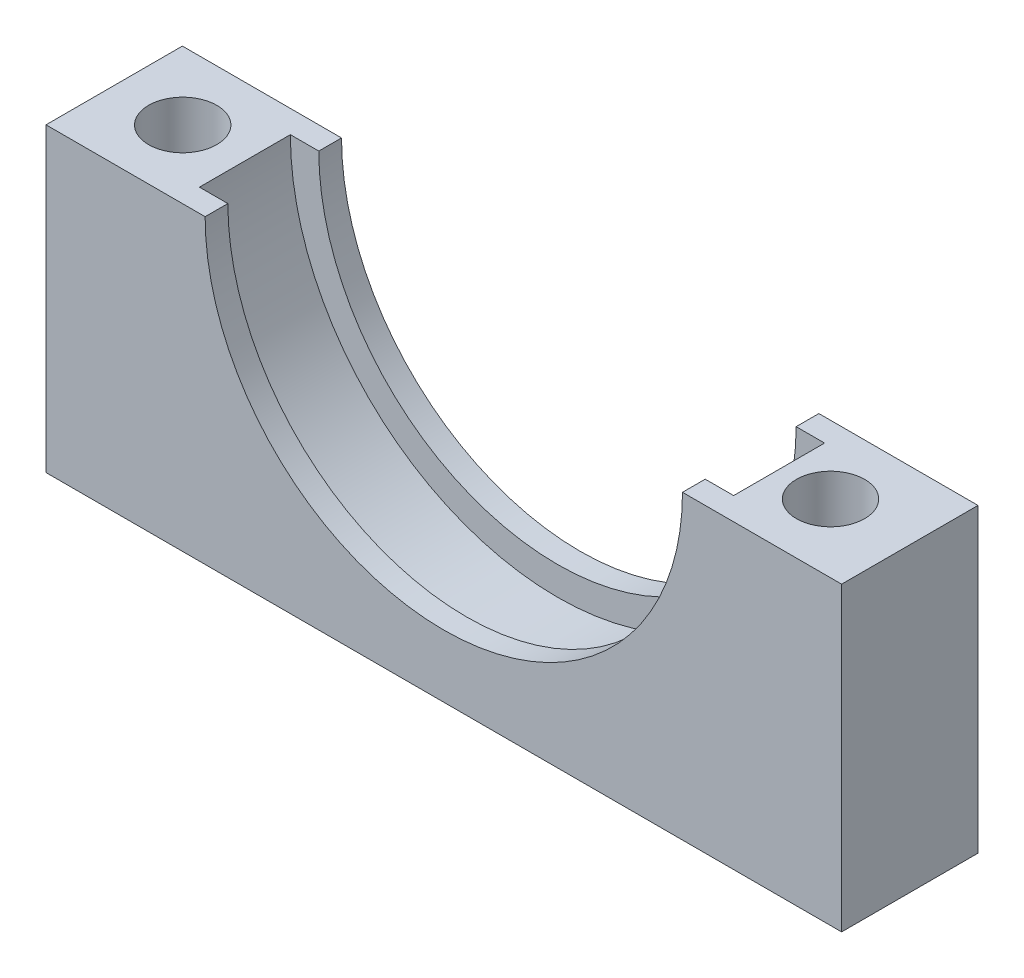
ISO-10303-21;
HEADER;
FILE_DESCRIPTION(('STEP AP214'),'2;1');
FILE_NAME('part.step','',(''),(''),'','','');
FILE_SCHEMA(('AUTOMOTIVE_DESIGN { 1 0 10303 214 1 1 1 1 }'));
ENDSEC;
DATA;
#1=APPLICATION_CONTEXT('core data for automotive mechanical design processes');
#2=APPLICATION_PROTOCOL_DEFINITION('international standard','automotive_design',2000,#1);
#3=PRODUCT_CONTEXT('',#1,'mechanical');
#4=PRODUCT('Part','Part','',(#3));
#5=PRODUCT_RELATED_PRODUCT_CATEGORY('part','',(#4));
#6=PRODUCT_DEFINITION_FORMATION('','',#4);
#7=PRODUCT_DEFINITION_CONTEXT('part definition',#1,'design');
#8=PRODUCT_DEFINITION('design','',#6,#7);
#9=PRODUCT_DEFINITION_SHAPE('','',#8);
#10=(LENGTH_UNIT() NAMED_UNIT(*) SI_UNIT(.MILLI.,.METRE.));
#11=(NAMED_UNIT(*) PLANE_ANGLE_UNIT() SI_UNIT($,.RADIAN.));
#12=(NAMED_UNIT(*) SI_UNIT($,.STERADIAN.) SOLID_ANGLE_UNIT());
#13=UNCERTAINTY_MEASURE_WITH_UNIT(LENGTH_MEASURE(1.E-05),#10,'distance_accuracy_value','');
#14=(GEOMETRIC_REPRESENTATION_CONTEXT(3) GLOBAL_UNCERTAINTY_ASSIGNED_CONTEXT((#13)) GLOBAL_UNIT_ASSIGNED_CONTEXT((#10,
#11,#12)) REPRESENTATION_CONTEXT('',''));
#15=CARTESIAN_POINT('',(0.,0.,0.));
#16=DIRECTION('',(0.,0.,1.));
#17=DIRECTION('',(1.,0.,0.));
#18=AXIS2_PLACEMENT_3D('',#15,#16,#17);
#19=CARTESIAN_POINT('',(53.,-25.,-86.8481796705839));
#20=DIRECTION('',(0.,1.,0.));
#21=DIRECTION('',(0.,0.,1.));
#22=AXIS2_PLACEMENT_3D('',#19,#20,#21);
#23=PLANE('',#22);
#24=CARTESIAN_POINT('',(45.0263356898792,-25.,-6.));
#25=DIRECTION('',(0.,1.,0.));
#26=DIRECTION('',(0.,0.,1.));
#27=AXIS2_PLACEMENT_3D('',#24,#25,#26);
#28=CIRCLE('',#27,3.);
#29=CARTESIAN_POINT('',(45.0263356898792,-25.,-3.));
#30=VERTEX_POINT('',#29);
#31=EDGE_CURVE('E206',#30,#30,#28,.T.);
#32=ORIENTED_EDGE('',*,*,#31,.F.);
#33=EDGE_LOOP('',(#32));
#34=FACE_BOUND('',#33,.T.);
#35=DIRECTION('',(0.,0.,-1.));
#36=VECTOR('',#35,1.);
#37=CARTESIAN_POINT('',(50.5,-25.,-2.));
#38=LINE('',#37,#36);
#39=CARTESIAN_POINT('',(50.5,-25.,-2.));
#40=VERTEX_POINT('',#39);
#41=CARTESIAN_POINT('',(50.5,-25.,-10.));
#42=VERTEX_POINT('',#41);
#43=EDGE_CURVE('E167',#40,#42,#38,.T.);
#44=ORIENTED_EDGE('',*,*,#43,.T.);
#45=DIRECTION('',(1.,0.,0.));
#46=VECTOR('',#45,1.);
#47=CARTESIAN_POINT('',(50.5,-25.,-10.));
#48=LINE('',#47,#46);
#49=CARTESIAN_POINT('',(53.,-25.,-10.));
#50=VERTEX_POINT('',#49);
#51=EDGE_CURVE('E189',#42,#50,#48,.T.);
#52=ORIENTED_EDGE('',*,*,#51,.T.);
#53=DIRECTION('',(0.,0.,1.));
#54=VECTOR('',#53,1.);
#55=CARTESIAN_POINT('',(53.,-25.,-86.8481796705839));
#56=LINE('',#55,#54);
#57=CARTESIAN_POINT('',(53.,-25.,-12.));
#58=VERTEX_POINT('',#57);
#59=EDGE_CURVE('E150',#58,#50,#56,.T.);
#60=ORIENTED_EDGE('',*,*,#59,.F.);
#61=DIRECTION('',(-1.,0.,0.));
#62=VECTOR('',#61,1.);
#63=CARTESIAN_POINT('',(53.,-25.,-12.));
#64=LINE('',#63,#62);
#65=CARTESIAN_POINT('',(39.,-25.,-12.));
#66=VERTEX_POINT('',#65);
#67=EDGE_CURVE('E80',#58,#66,#64,.T.);
#68=ORIENTED_EDGE('',*,*,#67,.T.);
#69=DIRECTION('',(0.,0.,1.));
#70=VECTOR('',#69,1.);
#71=CARTESIAN_POINT('',(39.,-25.,-86.8481796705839));
#72=LINE('',#71,#70);
#73=CARTESIAN_POINT('',(39.,-25.,0.));
#74=VERTEX_POINT('',#73);
#75=EDGE_CURVE('E130',#66,#74,#72,.T.);
#76=ORIENTED_EDGE('',*,*,#75,.T.);
#77=DIRECTION('',(-1.,0.,0.));
#78=VECTOR('',#77,1.);
#79=CARTESIAN_POINT('',(53.,-25.,0.));
#80=LINE('',#79,#78);
#81=CARTESIAN_POINT('',(53.,-25.,0.));
#82=VERTEX_POINT('',#81);
#83=EDGE_CURVE('E121',#82,#74,#80,.T.);
#84=ORIENTED_EDGE('',*,*,#83,.F.);
#85=CARTESIAN_POINT('',(53.,-25.,-2.));
#86=VERTEX_POINT('',#85);
#87=EDGE_CURVE('E53',#86,#82,#56,.T.);
#88=ORIENTED_EDGE('',*,*,#87,.F.);
#89=DIRECTION('',(1.,0.,0.));
#90=VECTOR('',#89,1.);
#91=CARTESIAN_POINT('',(50.5,-25.,-2.));
#92=LINE('',#91,#90);
#93=EDGE_CURVE('E45',#40,#86,#92,.T.);
#94=ORIENTED_EDGE('',*,*,#93,.F.);
#95=EDGE_LOOP('',(#44,#52,#60,#68,#76,#84,#88,#94));
#96=FACE_BOUND('',#95,.T.);
#97=ADVANCED_FACE('F30',(#34,#96),#23,.T.);
#98=CARTESIAN_POINT('',(109.,-25.,-86.8481796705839));
#99=DIRECTION('',(0.,1.,0.));
#100=DIRECTION('',(0.,0.,1.));
#101=AXIS2_PLACEMENT_3D('',#98,#99,#100);
#102=PLANE('',#101);
#103=CARTESIAN_POINT('',(102.026335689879,-25.,-6.));
#104=DIRECTION('',(0.,1.,0.));
#105=DIRECTION('',(0.,0.,1.));
#106=AXIS2_PLACEMENT_3D('',#103,#104,#105);
#107=CIRCLE('',#106,3.);
#108=CARTESIAN_POINT('',(102.026335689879,-25.,-3.));
#109=VERTEX_POINT('',#108);
#110=EDGE_CURVE('E213',#109,#109,#107,.T.);
#111=ORIENTED_EDGE('',*,*,#110,.F.);
#112=EDGE_LOOP('',(#111));
#113=FACE_BOUND('',#112,.T.);
#114=DIRECTION('',(0.,0.,1.));
#115=VECTOR('',#114,1.);
#116=CARTESIAN_POINT('',(95.,-25.,-86.8481796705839));
#117=LINE('',#116,#115);
#118=CARTESIAN_POINT('',(95.,-25.,-12.));
#119=VERTEX_POINT('',#118);
#120=CARTESIAN_POINT('',(95.,-25.,-10.));
#121=VERTEX_POINT('',#120);
#122=EDGE_CURVE('E134',#119,#121,#117,.T.);
#123=ORIENTED_EDGE('',*,*,#122,.T.);
#124=CARTESIAN_POINT('',(97.5,-25.,-10.));
#125=VERTEX_POINT('',#124);
#126=EDGE_CURVE('E175',#121,#125,#48,.T.);
#127=ORIENTED_EDGE('',*,*,#126,.T.);
#128=DIRECTION('',(0.,0.,-1.));
#129=VECTOR('',#128,1.);
#130=CARTESIAN_POINT('',(97.5,-25.,-2.));
#131=LINE('',#130,#129);
#132=CARTESIAN_POINT('',(97.5,-25.,-2.));
#133=VERTEX_POINT('',#132);
#134=EDGE_CURVE('E166',#133,#125,#131,.T.);
#135=ORIENTED_EDGE('',*,*,#134,.F.);
#136=CARTESIAN_POINT('',(95.,-25.,-2.));
#137=VERTEX_POINT('',#136);
#138=EDGE_CURVE('E156',#137,#133,#92,.T.);
#139=ORIENTED_EDGE('',*,*,#138,.F.);
#140=CARTESIAN_POINT('',(95.,-25.,0.));
#141=VERTEX_POINT('',#140);
#142=EDGE_CURVE('E138',#137,#141,#117,.T.);
#143=ORIENTED_EDGE('',*,*,#142,.T.);
#144=DIRECTION('',(-1.,0.,0.));
#145=VECTOR('',#144,1.);
#146=CARTESIAN_POINT('',(109.,-25.,0.));
#147=LINE('',#146,#145);
#148=CARTESIAN_POINT('',(109.,-25.,0.));
#149=VERTEX_POINT('',#148);
#150=EDGE_CURVE('E131',#149,#141,#147,.T.);
#151=ORIENTED_EDGE('',*,*,#150,.F.);
#152=DIRECTION('',(0.,0.,1.));
#153=VECTOR('',#152,1.);
#154=CARTESIAN_POINT('',(109.,-25.,-86.8481796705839));
#155=LINE('',#154,#153);
#156=CARTESIAN_POINT('',(109.,-25.,-12.));
#157=VERTEX_POINT('',#156);
#158=EDGE_CURVE('E139',#157,#149,#155,.T.);
#159=ORIENTED_EDGE('',*,*,#158,.F.);
#160=DIRECTION('',(-1.,0.,0.));
#161=VECTOR('',#160,1.);
#162=CARTESIAN_POINT('',(109.,-25.,-12.));
#163=LINE('',#162,#161);
#164=EDGE_CURVE('E135',#157,#119,#163,.T.);
#165=ORIENTED_EDGE('',*,*,#164,.T.);
#166=EDGE_LOOP('',(#123,#127,#135,#139,#143,#151,#159,#165));
#167=FACE_BOUND('',#166,.T.);
#168=ADVANCED_FACE('F162',(#113,#167),#102,.T.);
#169=CARTESIAN_POINT('',(74.,-25.,-86.8481796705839));
#170=DIRECTION('',(0.,0.,1.));
#171=DIRECTION('',(1.,0.,0.));
#172=AXIS2_PLACEMENT_3D('',#169,#170,#171);
#173=CYLINDRICAL_SURFACE('',#172,21.);
#174=ORIENTED_EDGE('',*,*,#59,.T.);
#175=CARTESIAN_POINT('',(74.,-25.,-9.99999999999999));
#176=DIRECTION('',(0.,0.,1.));
#177=DIRECTION('',(1.,0.,0.));
#178=AXIS2_PLACEMENT_3D('',#175,#176,#177);
#179=CIRCLE('',#178,21.);
#180=EDGE_CURVE('E12',#50,#121,#179,.T.);
#181=ORIENTED_EDGE('',*,*,#180,.T.);
#182=ORIENTED_EDGE('',*,*,#122,.F.);
#183=CARTESIAN_POINT('',(74.,-25.,-12.));
#184=DIRECTION('',(0.,0.,-1.));
#185=DIRECTION('',(-1.,0.,0.));
#186=AXIS2_PLACEMENT_3D('',#183,#184,#185);
#187=CIRCLE('',#186,21.);
#188=EDGE_CURVE('E132',#119,#58,#187,.T.);
#189=ORIENTED_EDGE('',*,*,#188,.T.);
#190=EDGE_LOOP('',(#174,#181,#182,#189));
#191=FACE_BOUND('',#190,.T.);
#192=ADVANCED_FACE('F249',(#191),#173,.F.);
#193=CARTESIAN_POINT('',(144.,19.,-12.));
#194=DIRECTION('',(0.,0.,-1.));
#195=DIRECTION('',(-1.,0.,0.));
#196=AXIS2_PLACEMENT_3D('',#193,#194,#195);
#197=PLANE('',#196);
#198=ORIENTED_EDGE('',*,*,#188,.F.);
#199=ORIENTED_EDGE('',*,*,#164,.F.);
#200=DIRECTION('',(0.,1.,0.));
#201=VECTOR('',#200,1.);
#202=CARTESIAN_POINT('',(109.,-51.5,-12.));
#203=LINE('',#202,#201);
#204=CARTESIAN_POINT('',(109.,-51.5,-12.));
#205=VERTEX_POINT('',#204);
#206=EDGE_CURVE('E140',#205,#157,#203,.T.);
#207=ORIENTED_EDGE('',*,*,#206,.F.);
#208=DIRECTION('',(1.,0.,0.));
#209=VECTOR('',#208,1.);
#210=CARTESIAN_POINT('',(39.,-51.5,-12.));
#211=LINE('',#210,#209);
#212=CARTESIAN_POINT('',(39.,-51.5,-12.));
#213=VERTEX_POINT('',#212);
#214=EDGE_CURVE('E107',#213,#205,#211,.T.);
#215=ORIENTED_EDGE('',*,*,#214,.F.);
#216=DIRECTION('',(0.,-1.,0.));
#217=VECTOR('',#216,1.);
#218=CARTESIAN_POINT('',(39.,-25.,-12.));
#219=LINE('',#218,#217);
#220=EDGE_CURVE('E86',#66,#213,#219,.T.);
#221=ORIENTED_EDGE('',*,*,#220,.F.);
#222=ORIENTED_EDGE('',*,*,#67,.F.);
#223=EDGE_LOOP('',(#198,#199,#207,#215,#221,#222));
#224=FACE_BOUND('',#223,.T.);
#225=ADVANCED_FACE('F32',(#224),#197,.T.);
#226=CARTESIAN_POINT('',(74.,-25.,0.));
#227=DIRECTION('',(0.,0.,-1.));
#228=DIRECTION('',(-1.,0.,0.));
#229=AXIS2_PLACEMENT_3D('',#226,#227,#228);
#230=PLANE('',#229);
#231=CARTESIAN_POINT('',(74.,-25.,0.));
#232=DIRECTION('',(0.,0.,-1.));
#233=DIRECTION('',(-1.,0.,0.));
#234=AXIS2_PLACEMENT_3D('',#231,#232,#233);
#235=CIRCLE('',#234,21.);
#236=EDGE_CURVE('E123',#141,#82,#235,.T.);
#237=ORIENTED_EDGE('',*,*,#236,.T.);
#238=ORIENTED_EDGE('',*,*,#83,.T.);
#239=DIRECTION('',(0.,-1.,0.));
#240=VECTOR('',#239,1.);
#241=CARTESIAN_POINT('',(39.,-25.,0.));
#242=LINE('',#241,#240);
#243=CARTESIAN_POINT('',(39.,-51.5,0.));
#244=VERTEX_POINT('',#243);
#245=EDGE_CURVE('E103',#74,#244,#242,.T.);
#246=ORIENTED_EDGE('',*,*,#245,.T.);
#247=DIRECTION('',(1.,0.,0.));
#248=VECTOR('',#247,1.);
#249=CARTESIAN_POINT('',(39.,-51.5,0.));
#250=LINE('',#249,#248);
#251=CARTESIAN_POINT('',(109.,-51.5,0.));
#252=VERTEX_POINT('',#251);
#253=EDGE_CURVE('E110',#244,#252,#250,.T.);
#254=ORIENTED_EDGE('',*,*,#253,.T.);
#255=DIRECTION('',(0.,1.,0.));
#256=VECTOR('',#255,1.);
#257=CARTESIAN_POINT('',(109.,-51.5,0.));
#258=LINE('',#257,#256);
#259=EDGE_CURVE('E117',#252,#149,#258,.T.);
#260=ORIENTED_EDGE('',*,*,#259,.T.);
#261=ORIENTED_EDGE('',*,*,#150,.T.);
#262=EDGE_LOOP('',(#237,#238,#246,#254,#260,#261));
#263=FACE_BOUND('',#262,.T.);
#264=ADVANCED_FACE('F120',(#263),#230,.F.);
#265=CARTESIAN_POINT('',(39.,-25.,-86.8481796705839));
#266=DIRECTION('',(-1.,0.,0.));
#267=DIRECTION('',(0.,0.,1.));
#268=AXIS2_PLACEMENT_3D('',#265,#266,#267);
#269=PLANE('',#268);
#270=ORIENTED_EDGE('',*,*,#75,.F.);
#271=ORIENTED_EDGE('',*,*,#220,.T.);
#272=DIRECTION('',(0.,0.,1.));
#273=VECTOR('',#272,1.);
#274=CARTESIAN_POINT('',(39.,-51.5,-86.8481796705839));
#275=LINE('',#274,#273);
#276=EDGE_CURVE('E99',#213,#244,#275,.T.);
#277=ORIENTED_EDGE('',*,*,#276,.T.);
#278=ORIENTED_EDGE('',*,*,#245,.F.);
#279=EDGE_LOOP('',(#270,#271,#277,#278));
#280=FACE_BOUND('',#279,.T.);
#281=ADVANCED_FACE('F101',(#280),#269,.T.);
#282=CARTESIAN_POINT('',(39.,-51.5,-86.8481796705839));
#283=DIRECTION('',(0.,-1.,0.));
#284=DIRECTION('',(0.,0.,-1.));
#285=AXIS2_PLACEMENT_3D('',#282,#283,#284);
#286=PLANE('',#285);
#287=CARTESIAN_POINT('',(102.026335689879,-51.5,-6.));
#288=DIRECTION('',(0.,-1.,0.));
#289=DIRECTION('',(0.,0.,-1.));
#290=AXIS2_PLACEMENT_3D('',#287,#288,#289);
#291=CIRCLE('',#290,3.);
#292=CARTESIAN_POINT('',(102.026335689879,-51.5,-9.));
#293=VERTEX_POINT('',#292);
#294=EDGE_CURVE('E216',#293,#293,#291,.T.);
#295=ORIENTED_EDGE('',*,*,#294,.F.);
#296=EDGE_LOOP('',(#295));
#297=FACE_BOUND('',#296,.T.);
#298=CARTESIAN_POINT('',(45.0263356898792,-51.5,-6.));
#299=DIRECTION('',(0.,-1.,0.));
#300=DIRECTION('',(0.,0.,-1.));
#301=AXIS2_PLACEMENT_3D('',#298,#299,#300);
#302=CIRCLE('',#301,3.);
#303=CARTESIAN_POINT('',(45.0263356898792,-51.5,-9.));
#304=VERTEX_POINT('',#303);
#305=EDGE_CURVE('E210',#304,#304,#302,.T.);
#306=ORIENTED_EDGE('',*,*,#305,.F.);
#307=EDGE_LOOP('',(#306));
#308=FACE_BOUND('',#307,.T.);
#309=ORIENTED_EDGE('',*,*,#276,.F.);
#310=ORIENTED_EDGE('',*,*,#214,.T.);
#311=DIRECTION('',(0.,0.,1.));
#312=VECTOR('',#311,1.);
#313=CARTESIAN_POINT('',(109.,-51.5,-86.8481796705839));
#314=LINE('',#313,#312);
#315=EDGE_CURVE('E113',#205,#252,#314,.T.);
#316=ORIENTED_EDGE('',*,*,#315,.T.);
#317=ORIENTED_EDGE('',*,*,#253,.F.);
#318=EDGE_LOOP('',(#309,#310,#316,#317));
#319=FACE_BOUND('',#318,.T.);
#320=ADVANCED_FACE('F111',(#297,#308,#319),#286,.T.);
#321=CARTESIAN_POINT('',(109.,-51.5,-86.8481796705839));
#322=DIRECTION('',(1.,0.,0.));
#323=DIRECTION('',(0.,1.,0.));
#324=AXIS2_PLACEMENT_3D('',#321,#322,#323);
#325=PLANE('',#324);
#326=ORIENTED_EDGE('',*,*,#315,.F.);
#327=ORIENTED_EDGE('',*,*,#206,.T.);
#328=ORIENTED_EDGE('',*,*,#158,.T.);
#329=ORIENTED_EDGE('',*,*,#259,.F.);
#330=EDGE_LOOP('',(#326,#327,#328,#329));
#331=FACE_BOUND('',#330,.T.);
#332=ADVANCED_FACE('F224',(#331),#325,.T.);
#333=CARTESIAN_POINT('',(74.,-25.,-2.));
#334=DIRECTION('',(0.,0.,1.));
#335=DIRECTION('',(1.,0.,0.));
#336=AXIS2_PLACEMENT_3D('',#333,#334,#335);
#337=CIRCLE('',#336,21.);
#338=EDGE_CURVE('E38',#86,#137,#337,.T.);
#339=ORIENTED_EDGE('',*,*,#338,.F.);
#340=ORIENTED_EDGE('',*,*,#87,.T.);
#341=ORIENTED_EDGE('',*,*,#236,.F.);
#342=ORIENTED_EDGE('',*,*,#142,.F.);
#343=EDGE_LOOP('',(#339,#340,#341,#342));
#344=FACE_BOUND('',#343,.T.);
#345=ADVANCED_FACE('F169',(#344),#173,.F.);
#346=CARTESIAN_POINT('',(74.,-88.1903194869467,-10.));
#347=DIRECTION('',(0.,0.,1.));
#348=DIRECTION('',(1.,0.,0.));
#349=AXIS2_PLACEMENT_3D('',#346,#347,#348);
#350=PLANE('',#349);
#351=ORIENTED_EDGE('',*,*,#51,.F.);
#352=CARTESIAN_POINT('',(74.,-25.,-10.));
#353=DIRECTION('',(0.,0.,-1.));
#354=DIRECTION('',(-1.,0.,0.));
#355=AXIS2_PLACEMENT_3D('',#352,#353,#354);
#356=CIRCLE('',#355,23.5);
#357=EDGE_CURVE('E184',#125,#42,#356,.T.);
#358=ORIENTED_EDGE('',*,*,#357,.F.);
#359=ORIENTED_EDGE('',*,*,#126,.F.);
#360=ORIENTED_EDGE('',*,*,#180,.F.);
#361=EDGE_LOOP('',(#351,#358,#359,#360));
#362=FACE_BOUND('',#361,.T.);
#363=ADVANCED_FACE('F233',(#362),#350,.T.);
#364=CARTESIAN_POINT('',(74.,-88.1903194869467,-2.));
#365=DIRECTION('',(0.,0.,1.));
#366=DIRECTION('',(1.,0.,0.));
#367=AXIS2_PLACEMENT_3D('',#364,#365,#366);
#368=PLANE('',#367);
#369=ORIENTED_EDGE('',*,*,#338,.T.);
#370=ORIENTED_EDGE('',*,*,#138,.T.);
#371=CARTESIAN_POINT('',(74.,-25.,-2.));
#372=DIRECTION('',(0.,0.,-1.));
#373=DIRECTION('',(-1.,0.,0.));
#374=AXIS2_PLACEMENT_3D('',#371,#372,#373);
#375=CIRCLE('',#374,23.5);
#376=EDGE_CURVE('E128',#133,#40,#375,.T.);
#377=ORIENTED_EDGE('',*,*,#376,.T.);
#378=ORIENTED_EDGE('',*,*,#93,.T.);
#379=EDGE_LOOP('',(#369,#370,#377,#378));
#380=FACE_BOUND('',#379,.T.);
#381=ADVANCED_FACE('F154',(#380),#368,.F.);
#382=CARTESIAN_POINT('',(74.,-25.,-2.));
#383=DIRECTION('',(0.,0.,-1.));
#384=DIRECTION('',(-1.,0.,0.));
#385=AXIS2_PLACEMENT_3D('',#382,#383,#384);
#386=CYLINDRICAL_SURFACE('',#385,23.5);
#387=ORIENTED_EDGE('',*,*,#357,.T.);
#388=ORIENTED_EDGE('',*,*,#43,.F.);
#389=ORIENTED_EDGE('',*,*,#376,.F.);
#390=ORIENTED_EDGE('',*,*,#134,.T.);
#391=EDGE_LOOP('',(#387,#388,#389,#390));
#392=FACE_BOUND('',#391,.T.);
#393=ADVANCED_FACE('F230',(#392),#386,.F.);
#394=CARTESIAN_POINT('',(45.0263356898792,-24.9998969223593,-6.));
#395=DIRECTION('',(0.,-1.,0.));
#396=DIRECTION('',(0.,0.,-1.));
#397=AXIS2_PLACEMENT_3D('',#394,#395,#396);
#398=CYLINDRICAL_SURFACE('',#397,3.);
#399=ORIENTED_EDGE('',*,*,#31,.T.);
#400=EDGE_LOOP('',(#399));
#401=FACE_BOUND('',#400,.T.);
#402=ORIENTED_EDGE('',*,*,#305,.T.);
#403=EDGE_LOOP('',(#402));
#404=FACE_BOUND('',#403,.T.);
#405=ADVANCED_FACE('F228',(#401,#404),#398,.F.);
#406=CARTESIAN_POINT('',(102.026335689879,-24.9998969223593,-6.));
#407=DIRECTION('',(0.,-1.,0.));
#408=DIRECTION('',(0.,0.,-1.));
#409=AXIS2_PLACEMENT_3D('',#406,#407,#408);
#410=CYLINDRICAL_SURFACE('',#409,3.);
#411=ORIENTED_EDGE('',*,*,#110,.T.);
#412=EDGE_LOOP('',(#411));
#413=FACE_BOUND('',#412,.T.);
#414=ORIENTED_EDGE('',*,*,#294,.T.);
#415=EDGE_LOOP('',(#414));
#416=FACE_BOUND('',#415,.T.);
#417=ADVANCED_FACE('F220',(#413,#416),#410,.F.);
#418=CLOSED_SHELL('',(#97,#168,#192,#225,#264,#281,#320,#332,#345,#363,#381,#393,#405,#417));
#419=MANIFOLD_SOLID_BREP('B2',#418);
#420=ADVANCED_BREP_SHAPE_REPRESENTATION('',(#18,#419),#14);
#421=SHAPE_DEFINITION_REPRESENTATION(#9,#420);
ENDSEC;
END-ISO-10303-21;
